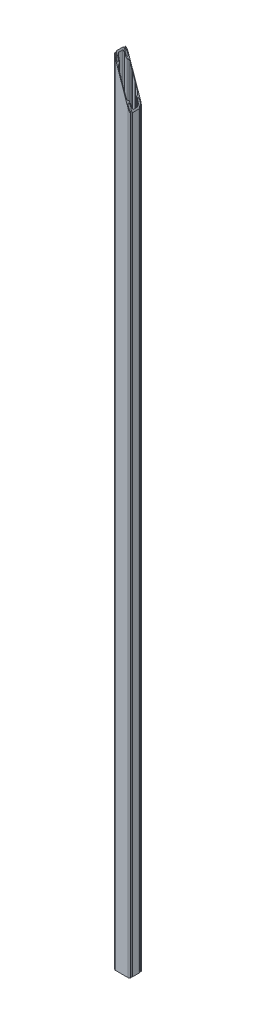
from build123d import *

# Parameters (mm, degrees)
SALIENTE_EXTRUIR1_DEPTH = 5000
CORTAR_EXTRUIR1_DEPTH   = 5001.889920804


with BuildPart() as part:
    # Croquis1 → Saliente-Extruir1 (new body)
    with BuildSketch(Plane(origin=(0, 0, 0), x_dir=(1, 0, 0), z_dir=(0, 1, 0))):
        with BuildLine():
            Line((39.5, -51.654327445), (-39.5, -51.654327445))
            ThreePointArc((-39.5, -51.654327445), (-45.378848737, -49.854277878), (-49.242036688, -45.071306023))
            ThreePointArc((-49.242036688, -45.071306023), (-48.132501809, -42.469588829), (-45.530784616, -43.579123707))
            ThreePointArc((-45.530784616, -43.579123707), (-33.301534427, -43.111116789), (-43.045454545, -35.706414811))
            ThreePointArc((-43.045454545, -35.706414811), (-47.645290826, -35.890503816), (-50, -31.934782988))
            Line((-50, -31.934782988), (-50, 8.626128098))
            ThreePointArc((-50, 8.626128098), (-47.645290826, 12.581848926), (-43.045454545, 12.397759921))
            ThreePointArc((-43.045454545, 12.397759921), (-33.301534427, 19.8024619), (-45.530784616, 20.270468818))
            ThreePointArc((-45.530784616, 20.270468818), (-48.132501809, 19.16093394), (-49.242036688, 21.762651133))
            ThreePointArc((-49.242036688, 21.762651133), (-45.378848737, 26.545622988), (-39.5, 28.345672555))
            Line((-39.5, 28.345672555), (39.5, 28.345672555))
            ThreePointArc((39.5, 28.345672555), (45.378848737, 26.545622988), (49.242036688, 21.762651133))
            ThreePointArc((49.242036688, 21.762651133), (48.132501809, 19.16093394), (45.530784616, 20.270468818))
            ThreePointArc((45.530784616, 20.270468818), (33.301534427, 19.8024619), (43.045454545, 12.397759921))
            ThreePointArc((43.045454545, 12.397759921), (47.645290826, 12.581848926), (50, 8.626128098))
            Line((50, 8.626128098), (50, -31.934782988))
            ThreePointArc((50, -31.934782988), (47.645290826, -35.890503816), (43.045454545, -35.706414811))
            ThreePointArc((43.045454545, -35.706414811), (33.301534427, -43.111116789), (45.530784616, -43.579123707))
            ThreePointArc((45.530784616, -43.579123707), (48.132501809, -42.469588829), (49.242036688, -45.071306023))
            ThreePointArc((49.242036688, -45.071306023), (45.378848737, -49.854277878), (39.5, -51.654327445))
        make_face()
        with BuildLine():
            Line((22.5, 24.345672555), (12.5, 24.345672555))
            Line((12.5, 24.345672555), (11, 22.845672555))
            Line((11, 22.845672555), (8, 22.845672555))
            Line((8, 22.845672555), (6.5, 24.345672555))
            Line((6.5, 24.345672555), (-6.5, 24.345672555))
            Line((-6.5, 24.345672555), (-8, 22.845672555))
            Line((-8, 22.845672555), (-11, 22.845672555))
            Line((-11, 22.845672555), (-12.5, 24.345672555))
            Line((-12.5, 24.345672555), (-22.5, 24.345672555))
            ThreePointArc((-22.5, 24.345672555), (-27.096194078, 22.441866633), (-29, 17.845672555))
            ThreePointArc((-29, 17.845672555), (-32.075378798, 10.421051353), (-39.5, 7.345672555))
            ThreePointArc((-39.5, 7.345672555), (-44.096194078, 5.441866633), (-46, 0.845672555))
            Line((-46, 0.845672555), (-46, -24.154327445))
            ThreePointArc((-46, -24.154327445), (-44.096194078, -28.750521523), (-39.5, -30.654327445))
            ThreePointArc((-39.5, -30.654327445), (-32.075378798, -33.729706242), (-29, -41.154327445))
            ThreePointArc((-29, -41.154327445), (-27.096194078, -45.750521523), (-22.5, -47.654327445))
            Line((-22.5, -47.654327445), (-12.5, -47.654327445))
            Line((-12.5, -47.654327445), (-11, -46.154327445))
            Line((-11, -46.154327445), (-8, -46.154327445))
            Line((-8, -46.154327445), (-6.5, -47.654327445))
            Line((-6.5, -47.654327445), (6.5, -47.654327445))
            Line((6.5, -47.654327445), (8, -46.154327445))
            Line((8, -46.154327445), (11, -46.154327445))
            Line((11, -46.154327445), (12.5, -47.654327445))
            Line((12.5, -47.654327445), (22.5, -47.654327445))
            ThreePointArc((22.5, -47.654327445), (27.096194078, -45.750521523), (29, -41.154327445))
            ThreePointArc((29, -41.154327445), (32.075378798, -33.729706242), (39.5, -30.654327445))
            ThreePointArc((39.5, -30.654327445), (44.096194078, -28.750521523), (46, -24.154327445))
            Line((46, -24.154327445), (46, 0.845672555))
            ThreePointArc((46, 0.845672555), (44.096194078, 5.441866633), (39.5, 7.345672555))
            ThreePointArc((39.5, 7.345672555), (32.075378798, 10.421051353), (29, 17.845672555))
            ThreePointArc((29, 17.845672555), (27.096194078, 22.441866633), (22.5, 24.345672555))
        make_face(mode=Mode.SUBTRACT)
    extrude(amount=SALIENTE_EXTRUIR1_DEPTH)

    # Croquis2 → Cortar-Extruir1 (cut, through all)
    with BuildSketch(Plane.XY.offset(51.654327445)):
        Polygon((-50, 5000), (50, 4711.542913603), (50, 5000), align=None)
    extrude(amount=-CORTAR_EXTRUIR1_DEPTH, mode=Mode.SUBTRACT)


solid = part.part
